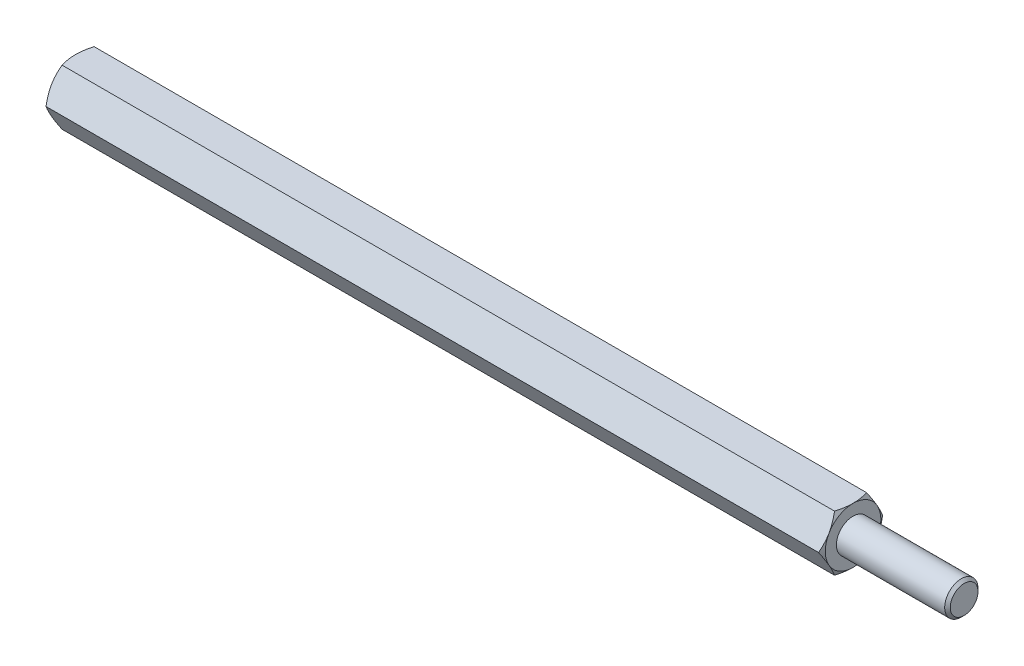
from build123d import *

# Parameters (mm, degrees)
EXTRUDE2_DEPTH = 35
SKETCH3_R      = 1.25
EXTRUDE3_DEPTH = 10
SKETCH5_R      = 1.5
EXTRUDE4_DEPTH = 10
CHAMFER1_SIZE  = 0.25


with BuildPart() as part:
    # Sketch1 → Extrude2 (new, symmetric)
    with BuildSketch(Plane(origin=(0, 0, 0), x_dir=(0, 0, -1), z_dir=(1, 0, 0))):
        Polygon((1.443375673, 2.5), (-1.443375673, 2.5), (-2.886751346, 0), (-1.443375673, -2.5), (1.443375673, -2.5), (2.886751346, 0), align=None)
    extrude(amount=EXTRUDE2_DEPTH, both=True)

    # Sketch2 → Cut-Revolve1 (revolve, cut)
    with BuildSketch(Plane.XY):
        with BuildLine():
            Line((-35, 2.5), (-33.5, 5.098076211))
            ThreePointArc((-33.5, 5.098076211), (-33.98810136, 6.276457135), (-35, 5.5))
            Line((-35, 5.5), (-35, 2.5))
        make_face()
    cut_revolve1 = revolve(axis=Axis((0, 0, 0), (1, 0, 0)), mode=Mode.SUBTRACT)

    # Mirror1: Cut-Revolve1 across plane
    add(cut_revolve1.mirror(Plane(origin=(0, 0, 0), x_dir=(0, 0, 1), z_dir=(1, 0, 0))), mode=Mode.SUBTRACT)

    # Sketch3 → Extrude3 (cut)
    with BuildSketch(Plane.ZY.offset(35)):
        Circle(SKETCH3_R)
    extrude(amount=-EXTRUDE3_DEPTH, mode=Mode.SUBTRACT)

    # Sketch4 → Cut-Revolve2 (revolve, cut)
    with BuildSketch(Plane.XY, mode=Mode.PRIVATE) as cut_revolve2_sk:
        Polygon((-25, 0), (-25, 1.25), (-24.278312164, 0), align=None)
    revolve(cut_revolve2_sk.sketch.rotate(Axis((-24.278312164, 0, 0), (-1, 0, 0)), 270), axis=Axis((-24.278312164, 0, 0), (-1, 0, 0)), mode=Mode.SUBTRACT)

    # Sketch5 → Extrude4 (add)
    with BuildSketch(Plane(origin=(35, 0, 0), x_dir=(0, 0, -1), z_dir=(1, 0, 0))):
        Circle(SKETCH5_R)
    extrude(amount=EXTRUDE4_DEPTH)

    # Chamfer1
    chamfer1_edges = [part.edges().sort_by_distance(p)[0] for p in [
        (45, 0, 1.5),
    ]]
    chamfer(chamfer1_edges, length=CHAMFER1_SIZE)


solid = part.part
